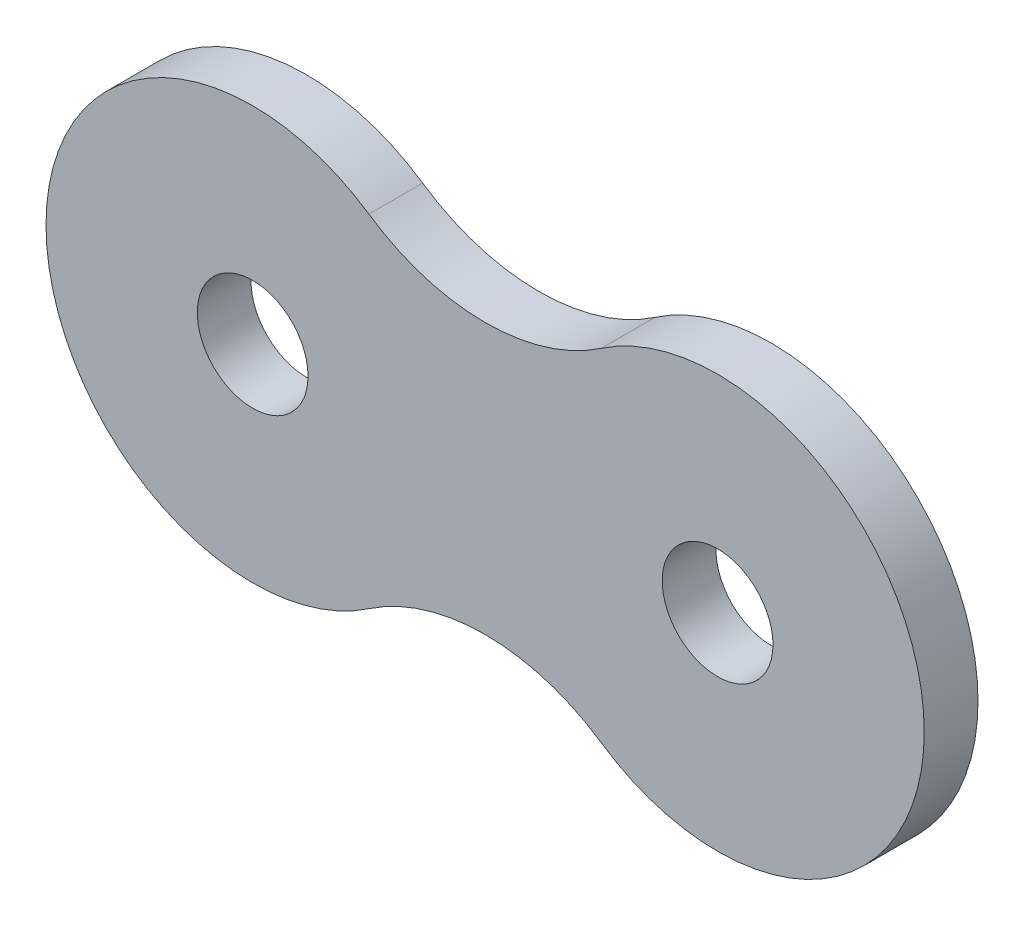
ISO-10303-21;
HEADER;
FILE_DESCRIPTION(('STEP AP214'),'2;1');
FILE_NAME('part.step','',(''),(''),'','','');
FILE_SCHEMA(('AUTOMOTIVE_DESIGN { 1 0 10303 214 1 1 1 1 }'));
ENDSEC;
DATA;
#1=APPLICATION_CONTEXT('core data for automotive mechanical design processes');
#2=APPLICATION_PROTOCOL_DEFINITION('international standard','automotive_design',2000,#1);
#3=PRODUCT_CONTEXT('',#1,'mechanical');
#4=PRODUCT('Part','Part','',(#3));
#5=PRODUCT_RELATED_PRODUCT_CATEGORY('part','',(#4));
#6=PRODUCT_DEFINITION_FORMATION('','',#4);
#7=PRODUCT_DEFINITION_CONTEXT('part definition',#1,'design');
#8=PRODUCT_DEFINITION('design','',#6,#7);
#9=PRODUCT_DEFINITION_SHAPE('','',#8);
#10=(LENGTH_UNIT() NAMED_UNIT(*) SI_UNIT(.MILLI.,.METRE.));
#11=(NAMED_UNIT(*) PLANE_ANGLE_UNIT() SI_UNIT($,.RADIAN.));
#12=(NAMED_UNIT(*) SI_UNIT($,.STERADIAN.) SOLID_ANGLE_UNIT());
#13=UNCERTAINTY_MEASURE_WITH_UNIT(LENGTH_MEASURE(1.E-05),#10,'distance_accuracy_value','');
#14=(GEOMETRIC_REPRESENTATION_CONTEXT(3) GLOBAL_UNCERTAINTY_ASSIGNED_CONTEXT((#13)) GLOBAL_UNIT_ASSIGNED_CONTEXT((#10,
#11,#12)) REPRESENTATION_CONTEXT('',''));
#15=CARTESIAN_POINT('',(0.,0.,0.));
#16=DIRECTION('',(0.,0.,1.));
#17=DIRECTION('',(1.,0.,0.));
#18=AXIS2_PLACEMENT_3D('',#15,#16,#17);
#19=CARTESIAN_POINT('',(-35.3085792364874,-7.00062016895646,2.202));
#20=DIRECTION('',(0.,0.,-1.));
#21=DIRECTION('',(-1.,0.,0.));
#22=AXIS2_PLACEMENT_3D('',#19,#20,#21);
#23=PLANE('',#22);
#24=CARTESIAN_POINT('',(-49.5960792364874,0.,2.202));
#25=DIRECTION('',(0.,0.,1.));
#26=DIRECTION('',(1.,0.,0.));
#27=AXIS2_PLACEMENT_3D('',#24,#25,#26);
#28=CIRCLE('',#27,2.269);
#29=CARTESIAN_POINT('',(-47.3270792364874,0.,2.202));
#30=VERTEX_POINT('',#29);
#31=EDGE_CURVE('E98',#30,#30,#28,.T.);
#32=ORIENTED_EDGE('',*,*,#31,.F.);
#33=EDGE_LOOP('',(#32));
#34=FACE_BOUND('',#33,.T.);
#35=CARTESIAN_POINT('',(-40.0710792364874,-14.0012403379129,2.202));
#36=DIRECTION('',(0.,0.,-1.));
#37=DIRECTION('',(-1.,0.,0.));
#38=AXIS2_PLACEMENT_3D('',#35,#36,#37);
#39=CIRCLE('',#38,8.467);
#40=CARTESIAN_POINT('',(-44.8335792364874,-7.00062016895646,2.202));
#41=VERTEX_POINT('',#40);
#42=CARTESIAN_POINT('',(-35.3085792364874,-7.00062016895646,2.202));
#43=VERTEX_POINT('',#42);
#44=EDGE_CURVE('E83',#41,#43,#39,.T.);
#45=ORIENTED_EDGE('',*,*,#44,.T.);
#46=CARTESIAN_POINT('',(-30.5460792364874,0.,2.202));
#47=DIRECTION('',(0.,0.,1.));
#48=DIRECTION('',(1.,0.,0.));
#49=AXIS2_PLACEMENT_3D('',#46,#47,#48);
#50=CIRCLE('',#49,8.467);
#51=CARTESIAN_POINT('',(-35.3085792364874,7.00062016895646,2.202));
#52=VERTEX_POINT('',#51);
#53=EDGE_CURVE('E78',#43,#52,#50,.T.);
#54=ORIENTED_EDGE('',*,*,#53,.T.);
#55=CARTESIAN_POINT('',(-40.0710792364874,14.0012403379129,2.202));
#56=DIRECTION('',(0.,0.,-1.));
#57=DIRECTION('',(1.,0.,0.));
#58=AXIS2_PLACEMENT_3D('',#55,#56,#57);
#59=CIRCLE('',#58,8.467);
#60=CARTESIAN_POINT('',(-44.8335792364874,7.00062016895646,2.202));
#61=VERTEX_POINT('',#60);
#62=EDGE_CURVE('E81',#52,#61,#59,.T.);
#63=ORIENTED_EDGE('',*,*,#62,.T.);
#64=CARTESIAN_POINT('',(-49.5960792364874,0.,2.202));
#65=DIRECTION('',(0.,0.,1.));
#66=DIRECTION('',(1.,0.,0.));
#67=AXIS2_PLACEMENT_3D('',#64,#65,#66);
#68=CIRCLE('',#67,8.467);
#69=EDGE_CURVE('E48',#61,#41,#68,.T.);
#70=ORIENTED_EDGE('',*,*,#69,.T.);
#71=EDGE_LOOP('',(#45,#54,#63,#70));
#72=FACE_BOUND('',#71,.T.);
#73=CARTESIAN_POINT('',(-30.5460792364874,0.,2.202));
#74=DIRECTION('',(0.,0.,1.));
#75=DIRECTION('',(1.,0.,0.));
#76=AXIS2_PLACEMENT_3D('',#73,#74,#75);
#77=CIRCLE('',#76,2.269);
#78=CARTESIAN_POINT('',(-28.2770792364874,0.,2.202));
#79=VERTEX_POINT('',#78);
#80=EDGE_CURVE('E113',#79,#79,#77,.T.);
#81=ORIENTED_EDGE('',*,*,#80,.F.);
#82=EDGE_LOOP('',(#81));
#83=FACE_BOUND('',#82,.T.);
#84=ADVANCED_FACE('F31',(#34,#72,#83),#23,.F.);
#85=CARTESIAN_POINT('',(-35.3085792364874,-7.00062016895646,0.));
#86=DIRECTION('',(0.,0.,-1.));
#87=DIRECTION('',(-1.,0.,0.));
#88=AXIS2_PLACEMENT_3D('',#85,#86,#87);
#89=PLANE('',#88);
#90=CARTESIAN_POINT('',(-49.5960792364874,0.,0.));
#91=DIRECTION('',(0.,0.,1.));
#92=DIRECTION('',(1.,0.,0.));
#93=AXIS2_PLACEMENT_3D('',#90,#91,#92);
#94=CIRCLE('',#93,2.269);
#95=CARTESIAN_POINT('',(-47.3270792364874,0.,0.));
#96=VERTEX_POINT('',#95);
#97=EDGE_CURVE('E110',#96,#96,#94,.T.);
#98=ORIENTED_EDGE('',*,*,#97,.T.);
#99=EDGE_LOOP('',(#98));
#100=FACE_BOUND('',#99,.T.);
#101=CARTESIAN_POINT('',(-40.0710792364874,-14.0012403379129,0.));
#102=DIRECTION('',(0.,0.,-1.));
#103=DIRECTION('',(-1.,0.,0.));
#104=AXIS2_PLACEMENT_3D('',#101,#102,#103);
#105=CIRCLE('',#104,8.467);
#106=CARTESIAN_POINT('',(-44.8335792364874,-7.00062016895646,0.));
#107=VERTEX_POINT('',#106);
#108=CARTESIAN_POINT('',(-35.3085792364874,-7.00062016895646,0.));
#109=VERTEX_POINT('',#108);
#110=EDGE_CURVE('E95',#107,#109,#105,.T.);
#111=ORIENTED_EDGE('',*,*,#110,.F.);
#112=CARTESIAN_POINT('',(-49.5960792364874,0.,0.));
#113=DIRECTION('',(0.,0.,1.));
#114=DIRECTION('',(1.,0.,0.));
#115=AXIS2_PLACEMENT_3D('',#112,#113,#114);
#116=CIRCLE('',#115,8.467);
#117=CARTESIAN_POINT('',(-44.8335792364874,7.00062016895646,0.));
#118=VERTEX_POINT('',#117);
#119=EDGE_CURVE('E71',#118,#107,#116,.T.);
#120=ORIENTED_EDGE('',*,*,#119,.F.);
#121=CARTESIAN_POINT('',(-40.0710792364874,14.0012403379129,0.));
#122=DIRECTION('',(0.,0.,-1.));
#123=DIRECTION('',(1.,0.,0.));
#124=AXIS2_PLACEMENT_3D('',#121,#122,#123);
#125=CIRCLE('',#124,8.467);
#126=CARTESIAN_POINT('',(-35.3085792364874,7.00062016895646,0.));
#127=VERTEX_POINT('',#126);
#128=EDGE_CURVE('E65',#127,#118,#125,.T.);
#129=ORIENTED_EDGE('',*,*,#128,.F.);
#130=CARTESIAN_POINT('',(-30.5460792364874,0.,0.));
#131=DIRECTION('',(0.,0.,1.));
#132=DIRECTION('',(1.,0.,0.));
#133=AXIS2_PLACEMENT_3D('',#130,#131,#132);
#134=CIRCLE('',#133,8.467);
#135=EDGE_CURVE('E87',#109,#127,#134,.T.);
#136=ORIENTED_EDGE('',*,*,#135,.F.);
#137=EDGE_LOOP('',(#111,#120,#129,#136));
#138=FACE_BOUND('',#137,.T.);
#139=CARTESIAN_POINT('',(-30.5460792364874,0.,0.));
#140=DIRECTION('',(0.,0.,1.));
#141=DIRECTION('',(1.,0.,0.));
#142=AXIS2_PLACEMENT_3D('',#139,#140,#141);
#143=CIRCLE('',#142,2.269);
#144=CARTESIAN_POINT('',(-28.2770792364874,0.,0.));
#145=VERTEX_POINT('',#144);
#146=EDGE_CURVE('E116',#145,#145,#143,.T.);
#147=ORIENTED_EDGE('',*,*,#146,.T.);
#148=EDGE_LOOP('',(#147));
#149=FACE_BOUND('',#148,.T.);
#150=ADVANCED_FACE('F106',(#100,#138,#149),#89,.T.);
#151=CARTESIAN_POINT('',(-40.0710792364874,-14.0012403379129,2.202));
#152=DIRECTION('',(0.,0.,-1.));
#153=DIRECTION('',(-1.,0.,0.));
#154=AXIS2_PLACEMENT_3D('',#151,#152,#153);
#155=CYLINDRICAL_SURFACE('',#154,8.467);
#156=ORIENTED_EDGE('',*,*,#110,.T.);
#157=DIRECTION('',(0.,0.,-1.));
#158=VECTOR('',#157,1.);
#159=CARTESIAN_POINT('',(-35.3085792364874,-7.00062016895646,2.202));
#160=LINE('',#159,#158);
#161=EDGE_CURVE('E11',#43,#109,#160,.T.);
#162=ORIENTED_EDGE('',*,*,#161,.F.);
#163=ORIENTED_EDGE('',*,*,#44,.F.);
#164=DIRECTION('',(0.,0.,-1.));
#165=VECTOR('',#164,1.);
#166=CARTESIAN_POINT('',(-44.8335792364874,-7.00062016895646,2.202));
#167=LINE('',#166,#165);
#168=EDGE_CURVE('E91',#41,#107,#167,.T.);
#169=ORIENTED_EDGE('',*,*,#168,.T.);
#170=EDGE_LOOP('',(#156,#162,#163,#169));
#171=FACE_BOUND('',#170,.T.);
#172=ADVANCED_FACE('F33',(#171),#155,.F.);
#173=CARTESIAN_POINT('',(-30.5460792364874,0.,2.202));
#174=DIRECTION('',(0.,0.,-1.));
#175=DIRECTION('',(-1.,0.,0.));
#176=AXIS2_PLACEMENT_3D('',#173,#174,#175);
#177=CYLINDRICAL_SURFACE('',#176,8.467);
#178=ORIENTED_EDGE('',*,*,#135,.T.);
#179=DIRECTION('',(0.,0.,-1.));
#180=VECTOR('',#179,1.);
#181=CARTESIAN_POINT('',(-35.3085792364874,7.00062016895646,2.202));
#182=LINE('',#181,#180);
#183=EDGE_CURVE('E40',#52,#127,#182,.T.);
#184=ORIENTED_EDGE('',*,*,#183,.F.);
#185=ORIENTED_EDGE('',*,*,#53,.F.);
#186=ORIENTED_EDGE('',*,*,#161,.T.);
#187=EDGE_LOOP('',(#178,#184,#185,#186));
#188=FACE_BOUND('',#187,.T.);
#189=ADVANCED_FACE('F86',(#188),#177,.T.);
#190=CARTESIAN_POINT('',(-40.0710792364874,14.0012403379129,2.202));
#191=DIRECTION('',(0.,0.,-1.));
#192=DIRECTION('',(-1.,0.,0.));
#193=AXIS2_PLACEMENT_3D('',#190,#191,#192);
#194=CYLINDRICAL_SURFACE('',#193,8.467);
#195=ORIENTED_EDGE('',*,*,#128,.T.);
#196=DIRECTION('',(0.,0.,-1.));
#197=VECTOR('',#196,1.);
#198=CARTESIAN_POINT('',(-44.8335792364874,7.00062016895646,2.202));
#199=LINE('',#198,#197);
#200=EDGE_CURVE('E88',#61,#118,#199,.T.);
#201=ORIENTED_EDGE('',*,*,#200,.F.);
#202=ORIENTED_EDGE('',*,*,#62,.F.);
#203=ORIENTED_EDGE('',*,*,#183,.T.);
#204=EDGE_LOOP('',(#195,#201,#202,#203));
#205=FACE_BOUND('',#204,.T.);
#206=ADVANCED_FACE('F89',(#205),#194,.F.);
#207=CARTESIAN_POINT('',(-49.5960792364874,0.,2.202));
#208=DIRECTION('',(0.,0.,-1.));
#209=DIRECTION('',(-1.,0.,0.));
#210=AXIS2_PLACEMENT_3D('',#207,#208,#209);
#211=CYLINDRICAL_SURFACE('',#210,8.467);
#212=ORIENTED_EDGE('',*,*,#119,.T.);
#213=ORIENTED_EDGE('',*,*,#168,.F.);
#214=ORIENTED_EDGE('',*,*,#69,.F.);
#215=ORIENTED_EDGE('',*,*,#200,.T.);
#216=EDGE_LOOP('',(#212,#213,#214,#215));
#217=FACE_BOUND('',#216,.T.);
#218=ADVANCED_FACE('F103',(#217),#211,.T.);
#219=CARTESIAN_POINT('',(-49.5960792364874,0.,2.202));
#220=DIRECTION('',(0.,0.,-1.));
#221=DIRECTION('',(-1.,0.,0.));
#222=AXIS2_PLACEMENT_3D('',#219,#220,#221);
#223=CYLINDRICAL_SURFACE('',#222,2.269);
#224=ORIENTED_EDGE('',*,*,#31,.T.);
#225=EDGE_LOOP('',(#224));
#226=FACE_BOUND('',#225,.T.);
#227=ORIENTED_EDGE('',*,*,#97,.F.);
#228=EDGE_LOOP('',(#227));
#229=FACE_BOUND('',#228,.T.);
#230=ADVANCED_FACE('F134',(#226,#229),#223,.F.);
#231=CARTESIAN_POINT('',(-30.5460792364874,0.,2.202));
#232=DIRECTION('',(0.,0.,-1.));
#233=DIRECTION('',(-1.,0.,0.));
#234=AXIS2_PLACEMENT_3D('',#231,#232,#233);
#235=CYLINDRICAL_SURFACE('',#234,2.269);
#236=ORIENTED_EDGE('',*,*,#80,.T.);
#237=EDGE_LOOP('',(#236));
#238=FACE_BOUND('',#237,.T.);
#239=ORIENTED_EDGE('',*,*,#146,.F.);
#240=EDGE_LOOP('',(#239));
#241=FACE_BOUND('',#240,.T.);
#242=ADVANCED_FACE('F122',(#238,#241),#235,.F.);
#243=CLOSED_SHELL('',(#84,#150,#172,#189,#206,#218,#230,#242));
#244=MANIFOLD_SOLID_BREP('B2',#243);
#245=ADVANCED_BREP_SHAPE_REPRESENTATION('',(#18,#244),#14);
#246=SHAPE_DEFINITION_REPRESENTATION(#9,#245);
ENDSEC;
END-ISO-10303-21;
